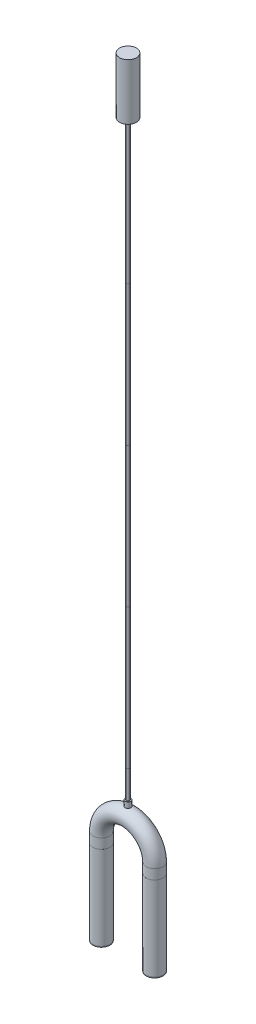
ISO-10303-21;
HEADER;
FILE_DESCRIPTION(('STEP AP214'),'2;1');
FILE_NAME('part.step','',(''),(''),'','','');
FILE_SCHEMA(('AUTOMOTIVE_DESIGN { 1 0 10303 214 1 1 1 1 }'));
ENDSEC;
DATA;
#1=APPLICATION_CONTEXT('core data for automotive mechanical design processes');
#2=APPLICATION_PROTOCOL_DEFINITION('international standard','automotive_design',2000,#1);
#3=PRODUCT_CONTEXT('',#1,'mechanical');
#4=PRODUCT('Part','Part','',(#3));
#5=PRODUCT_RELATED_PRODUCT_CATEGORY('part','',(#4));
#6=PRODUCT_DEFINITION_FORMATION('','',#4);
#7=PRODUCT_DEFINITION_CONTEXT('part definition',#1,'design');
#8=PRODUCT_DEFINITION('design','',#6,#7);
#9=PRODUCT_DEFINITION_SHAPE('','',#8);
#10=(LENGTH_UNIT() NAMED_UNIT(*) SI_UNIT(.MILLI.,.METRE.));
#11=(NAMED_UNIT(*) PLANE_ANGLE_UNIT() SI_UNIT($,.RADIAN.));
#12=(NAMED_UNIT(*) SI_UNIT($,.STERADIAN.) SOLID_ANGLE_UNIT());
#13=UNCERTAINTY_MEASURE_WITH_UNIT(LENGTH_MEASURE(1.E-05),#10,'distance_accuracy_value','');
#14=(GEOMETRIC_REPRESENTATION_CONTEXT(3) GLOBAL_UNCERTAINTY_ASSIGNED_CONTEXT((#13)) GLOBAL_UNIT_ASSIGNED_CONTEXT((#10,
#11,#12)) REPRESENTATION_CONTEXT('',''));
#15=CARTESIAN_POINT('',(0.,0.,0.));
#16=DIRECTION('',(0.,0.,1.));
#17=DIRECTION('',(1.,0.,0.));
#18=AXIS2_PLACEMENT_3D('',#15,#16,#17);
#19=CARTESIAN_POINT('',(0.,2490.,0.));
#20=DIRECTION('',(0.,-1.,0.));
#21=DIRECTION('',(0.,0.,-1.));
#22=AXIS2_PLACEMENT_3D('',#19,#20,#21);
#23=CYLINDRICAL_SURFACE('',#22,30.);
#24=CARTESIAN_POINT('',(0.,2490.,0.));
#25=DIRECTION('',(0.,1.,0.));
#26=DIRECTION('',(0.,0.,1.));
#27=AXIS2_PLACEMENT_3D('',#24,#25,#26);
#28=CIRCLE('',#27,30.);
#29=CARTESIAN_POINT('',(0.,2490.,30.));
#30=VERTEX_POINT('',#29);
#31=EDGE_CURVE('E12',#30,#30,#28,.T.);
#32=ORIENTED_EDGE('',*,*,#31,.F.);
#33=EDGE_LOOP('',(#32));
#34=FACE_BOUND('',#33,.T.);
#35=CARTESIAN_POINT('',(0.,2290.,0.));
#36=DIRECTION('',(0.,1.,0.));
#37=DIRECTION('',(0.,0.,1.));
#38=AXIS2_PLACEMENT_3D('',#35,#36,#37);
#39=CIRCLE('',#38,30.);
#40=CARTESIAN_POINT('',(0.,2290.,30.));
#41=VERTEX_POINT('',#40);
#42=EDGE_CURVE('E55',#41,#41,#39,.T.);
#43=ORIENTED_EDGE('',*,*,#42,.T.);
#44=EDGE_LOOP('',(#43));
#45=FACE_BOUND('',#44,.T.);
#46=ADVANCED_FACE('F52',(#34,#45),#23,.T.);
#47=CARTESIAN_POINT('',(0.,2490.,0.));
#48=DIRECTION('',(0.,1.,0.));
#49=DIRECTION('',(0.,0.,1.));
#50=AXIS2_PLACEMENT_3D('',#47,#48,#49);
#51=PLANE('',#50);
#52=ORIENTED_EDGE('',*,*,#31,.T.);
#53=EDGE_LOOP('',(#52));
#54=FACE_BOUND('',#53,.T.);
#55=ADVANCED_FACE('F67',(#54),#51,.T.);
#56=CARTESIAN_POINT('',(0.,2290.,0.));
#57=DIRECTION('',(0.,1.,0.));
#58=DIRECTION('',(0.,0.,1.));
#59=AXIS2_PLACEMENT_3D('',#56,#57,#58);
#60=PLANE('',#59);
#61=ORIENTED_EDGE('',*,*,#42,.F.);
#62=EDGE_LOOP('',(#61));
#63=FACE_BOUND('',#62,.T.);
#64=ADVANCED_FACE('F65',(#63),#60,.F.);
#65=CLOSED_SHELL('',(#46,#55,#64));
#66=MANIFOLD_SOLID_BREP('B2',#65);
#67=CARTESIAN_POINT('',(0.,2290.,0.));
#68=DIRECTION('',(0.,-1.,0.));
#69=DIRECTION('',(0.,0.,-1.));
#70=AXIS2_PLACEMENT_3D('',#67,#68,#69);
#71=CYLINDRICAL_SURFACE('',#70,7.5);
#72=CARTESIAN_POINT('',(0.,2290.,0.));
#73=DIRECTION('',(0.,1.,0.));
#74=DIRECTION('',(0.,0.,1.));
#75=AXIS2_PLACEMENT_3D('',#72,#73,#74);
#76=CIRCLE('',#75,7.5);
#77=CARTESIAN_POINT('',(0.,2290.,7.5));
#78=VERTEX_POINT('',#77);
#79=EDGE_CURVE('E51',#78,#78,#76,.T.);
#80=ORIENTED_EDGE('',*,*,#79,.F.);
#81=EDGE_LOOP('',(#80));
#82=FACE_BOUND('',#81,.T.);
#83=CARTESIAN_POINT('',(0.,2280.,0.));
#84=DIRECTION('',(0.,1.,0.));
#85=DIRECTION('',(0.,0.,1.));
#86=AXIS2_PLACEMENT_3D('',#83,#84,#85);
#87=CIRCLE('',#86,7.5);
#88=CARTESIAN_POINT('',(0.,2280.,7.5));
#89=VERTEX_POINT('',#88);
#90=EDGE_CURVE('E104',#89,#89,#87,.T.);
#91=ORIENTED_EDGE('',*,*,#90,.T.);
#92=EDGE_LOOP('',(#91));
#93=FACE_BOUND('',#92,.T.);
#94=ADVANCED_FACE('F101',(#82,#93),#71,.T.);
#95=CARTESIAN_POINT('',(0.,2290.,0.));
#96=DIRECTION('',(0.,1.,0.));
#97=DIRECTION('',(0.,0.,1.));
#98=AXIS2_PLACEMENT_3D('',#95,#96,#97);
#99=PLANE('',#98);
#100=ORIENTED_EDGE('',*,*,#79,.T.);
#101=EDGE_LOOP('',(#100));
#102=FACE_BOUND('',#101,.T.);
#103=ADVANCED_FACE('F116',(#102),#99,.T.);
#104=CARTESIAN_POINT('',(0.,2280.,0.));
#105=DIRECTION('',(0.,1.,0.));
#106=DIRECTION('',(0.,0.,1.));
#107=AXIS2_PLACEMENT_3D('',#104,#105,#106);
#108=PLANE('',#107);
#109=ORIENTED_EDGE('',*,*,#90,.F.);
#110=EDGE_LOOP('',(#109));
#111=FACE_BOUND('',#110,.T.);
#112=ADVANCED_FACE('F114',(#111),#108,.F.);
#113=CLOSED_SHELL('',(#94,#103,#112));
#114=MANIFOLD_SOLID_BREP('B7',#113);
#115=CARTESIAN_POINT('',(94.9999999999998,-303.,0.));
#116=DIRECTION('',(0.,1.,0.));
#117=DIRECTION('',(-1.,0.,0.));
#118=AXIS2_PLACEMENT_3D('',#115,#116,#117);
#119=CYLINDRICAL_SURFACE('',#118,30.);
#120=CARTESIAN_POINT('',(94.9999999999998,-303.,0.));
#121=DIRECTION('',(0.,-1.,0.));
#122=DIRECTION('',(1.,0.,0.));
#123=AXIS2_PLACEMENT_3D('',#120,#121,#122);
#124=CIRCLE('',#123,30.);
#125=CARTESIAN_POINT('',(125.,-303.,0.));
#126=VERTEX_POINT('',#125);
#127=EDGE_CURVE('E100',#126,#126,#124,.T.);
#128=ORIENTED_EDGE('',*,*,#127,.F.);
#129=EDGE_LOOP('',(#128));
#130=FACE_BOUND('',#129,.T.);
#131=CARTESIAN_POINT('',(94.9999999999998,-300.,0.));
#132=DIRECTION('',(0.,-1.,0.));
#133=DIRECTION('',(1.,0.,0.));
#134=AXIS2_PLACEMENT_3D('',#131,#132,#133);
#135=CIRCLE('',#134,30.);
#136=CARTESIAN_POINT('',(125.,-300.,0.));
#137=VERTEX_POINT('',#136);
#138=EDGE_CURVE('E153',#137,#137,#135,.T.);
#139=ORIENTED_EDGE('',*,*,#138,.T.);
#140=EDGE_LOOP('',(#139));
#141=FACE_BOUND('',#140,.T.);
#142=ADVANCED_FACE('F150',(#130,#141),#119,.T.);
#143=CARTESIAN_POINT('',(94.9999999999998,-303.,0.));
#144=DIRECTION('',(0.,-1.,0.));
#145=DIRECTION('',(1.,0.,0.));
#146=AXIS2_PLACEMENT_3D('',#143,#144,#145);
#147=PLANE('',#146);
#148=ORIENTED_EDGE('',*,*,#127,.T.);
#149=EDGE_LOOP('',(#148));
#150=FACE_BOUND('',#149,.T.);
#151=ADVANCED_FACE('F165',(#150),#147,.T.);
#152=CARTESIAN_POINT('',(94.9999999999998,-300.,0.));
#153=DIRECTION('',(0.,-1.,0.));
#154=DIRECTION('',(1.,0.,0.));
#155=AXIS2_PLACEMENT_3D('',#152,#153,#154);
#156=PLANE('',#155);
#157=ORIENTED_EDGE('',*,*,#138,.F.);
#158=EDGE_LOOP('',(#157));
#159=FACE_BOUND('',#158,.T.);
#160=ADVANCED_FACE('F163',(#159),#156,.F.);
#161=CLOSED_SHELL('',(#142,#151,#160));
#162=MANIFOLD_SOLID_BREP('B46',#161);
#163=CARTESIAN_POINT('',(-95.0000000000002,-303.,0.));
#164=DIRECTION('',(0.,1.,0.));
#165=DIRECTION('',(-1.,0.,0.));
#166=AXIS2_PLACEMENT_3D('',#163,#164,#165);
#167=CYLINDRICAL_SURFACE('',#166,30.);
#168=CARTESIAN_POINT('',(-95.0000000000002,-303.,0.));
#169=DIRECTION('',(0.,-1.,0.));
#170=DIRECTION('',(1.,0.,0.));
#171=AXIS2_PLACEMENT_3D('',#168,#169,#170);
#172=CIRCLE('',#171,30.);
#173=CARTESIAN_POINT('',(-65.0000000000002,-303.,0.));
#174=VERTEX_POINT('',#173);
#175=EDGE_CURVE('E149',#174,#174,#172,.T.);
#176=ORIENTED_EDGE('',*,*,#175,.F.);
#177=EDGE_LOOP('',(#176));
#178=FACE_BOUND('',#177,.T.);
#179=CARTESIAN_POINT('',(-95.0000000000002,-300.,0.));
#180=DIRECTION('',(0.,-1.,0.));
#181=DIRECTION('',(1.,0.,0.));
#182=AXIS2_PLACEMENT_3D('',#179,#180,#181);
#183=CIRCLE('',#182,30.);
#184=CARTESIAN_POINT('',(-65.0000000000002,-300.,0.));
#185=VERTEX_POINT('',#184);
#186=EDGE_CURVE('E202',#185,#185,#183,.T.);
#187=ORIENTED_EDGE('',*,*,#186,.T.);
#188=EDGE_LOOP('',(#187));
#189=FACE_BOUND('',#188,.T.);
#190=ADVANCED_FACE('F199',(#178,#189),#167,.T.);
#191=CARTESIAN_POINT('',(-95.0000000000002,-303.,0.));
#192=DIRECTION('',(0.,-1.,0.));
#193=DIRECTION('',(1.,0.,0.));
#194=AXIS2_PLACEMENT_3D('',#191,#192,#193);
#195=PLANE('',#194);
#196=ORIENTED_EDGE('',*,*,#175,.T.);
#197=EDGE_LOOP('',(#196));
#198=FACE_BOUND('',#197,.T.);
#199=ADVANCED_FACE('F214',(#198),#195,.T.);
#200=CARTESIAN_POINT('',(-95.0000000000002,-300.,0.));
#201=DIRECTION('',(0.,-1.,0.));
#202=DIRECTION('',(1.,0.,0.));
#203=AXIS2_PLACEMENT_3D('',#200,#201,#202);
#204=PLANE('',#203);
#205=ORIENTED_EDGE('',*,*,#186,.F.);
#206=EDGE_LOOP('',(#205));
#207=FACE_BOUND('',#206,.T.);
#208=ADVANCED_FACE('F212',(#207),#204,.F.);
#209=CLOSED_SHELL('',(#190,#199,#208));
#210=MANIFOLD_SOLID_BREP('B95',#209);
#211=CARTESIAN_POINT('',(-95.0000000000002,-300.,0.));
#212=DIRECTION('',(0.,-1.,0.));
#213=DIRECTION('',(1.,0.,0.));
#214=AXIS2_PLACEMENT_3D('',#211,#212,#213);
#215=PLANE('',#214);
#216=CARTESIAN_POINT('',(-95.0000000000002,-300.,0.));
#217=DIRECTION('',(0.,-1.,0.));
#218=DIRECTION('',(1.,0.,0.));
#219=AXIS2_PLACEMENT_3D('',#216,#217,#218);
#220=CIRCLE('',#219,30.);
#221=CARTESIAN_POINT('',(-65.0000000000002,-300.,0.));
#222=VERTEX_POINT('',#221);
#223=EDGE_CURVE('E198',#222,#222,#220,.T.);
#224=ORIENTED_EDGE('',*,*,#223,.T.);
#225=EDGE_LOOP('',(#224));
#226=FACE_BOUND('',#225,.T.);
#227=CARTESIAN_POINT('',(-95.0000000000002,-300.,0.));
#228=DIRECTION('',(0.,-1.,0.));
#229=DIRECTION('',(1.,0.,0.));
#230=AXIS2_PLACEMENT_3D('',#227,#228,#229);
#231=CIRCLE('',#230,27.);
#232=CARTESIAN_POINT('',(-68.0000000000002,-300.,0.));
#233=VERTEX_POINT('',#232);
#234=EDGE_CURVE('E259',#233,#233,#231,.T.);
#235=ORIENTED_EDGE('',*,*,#234,.F.);
#236=EDGE_LOOP('',(#235));
#237=FACE_BOUND('',#236,.T.);
#238=ADVANCED_FACE('F248',(#226,#237),#215,.T.);
#239=CARTESIAN_POINT('',(-95.,0.,0.));
#240=DIRECTION('',(0.,-1.,0.));
#241=DIRECTION('',(1.,0.,0.));
#242=AXIS2_PLACEMENT_3D('',#239,#240,#241);
#243=PLANE('',#242);
#244=CARTESIAN_POINT('',(-95.,0.,0.));
#245=DIRECTION('',(0.,-1.,0.));
#246=DIRECTION('',(1.,0.,0.));
#247=AXIS2_PLACEMENT_3D('',#244,#245,#246);
#248=CIRCLE('',#247,30.);
#249=CARTESIAN_POINT('',(-65.,0.,0.));
#250=VERTEX_POINT('',#249);
#251=EDGE_CURVE('E252',#250,#250,#248,.T.);
#252=ORIENTED_EDGE('',*,*,#251,.F.);
#253=EDGE_LOOP('',(#252));
#254=FACE_BOUND('',#253,.T.);
#255=CARTESIAN_POINT('',(-95.,0.,0.));
#256=DIRECTION('',(0.,-1.,0.));
#257=DIRECTION('',(1.,0.,0.));
#258=AXIS2_PLACEMENT_3D('',#255,#256,#257);
#259=CIRCLE('',#258,27.);
#260=CARTESIAN_POINT('',(-68.,0.,0.));
#261=VERTEX_POINT('',#260);
#262=EDGE_CURVE('E261',#261,#261,#259,.T.);
#263=ORIENTED_EDGE('',*,*,#262,.T.);
#264=EDGE_LOOP('',(#263));
#265=FACE_BOUND('',#264,.T.);
#266=ADVANCED_FACE('F271',(#254,#265),#243,.F.);
#267=CARTESIAN_POINT('',(-95.0000000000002,-300.,0.));
#268=DIRECTION('',(0.,1.,0.));
#269=DIRECTION('',(-1.,0.,0.));
#270=AXIS2_PLACEMENT_3D('',#267,#268,#269);
#271=CYLINDRICAL_SURFACE('',#270,30.);
#272=ORIENTED_EDGE('',*,*,#223,.F.);
#273=EDGE_LOOP('',(#272));
#274=FACE_BOUND('',#273,.T.);
#275=ORIENTED_EDGE('',*,*,#251,.T.);
#276=EDGE_LOOP('',(#275));
#277=FACE_BOUND('',#276,.T.);
#278=ADVANCED_FACE('F250',(#274,#277),#271,.T.);
#279=CARTESIAN_POINT('',(-95.0000000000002,-300.,0.));
#280=DIRECTION('',(0.,1.,0.));
#281=DIRECTION('',(-1.,0.,0.));
#282=AXIS2_PLACEMENT_3D('',#279,#280,#281);
#283=CYLINDRICAL_SURFACE('',#282,27.);
#284=ORIENTED_EDGE('',*,*,#234,.T.);
#285=EDGE_LOOP('',(#284));
#286=FACE_BOUND('',#285,.T.);
#287=ORIENTED_EDGE('',*,*,#262,.F.);
#288=EDGE_LOOP('',(#287));
#289=FACE_BOUND('',#288,.T.);
#290=ADVANCED_FACE('F267',(#286,#289),#283,.F.);
#291=CLOSED_SHELL('',(#238,#266,#278,#290));
#292=MANIFOLD_SOLID_BREP('B144',#291);
#293=CARTESIAN_POINT('',(94.9999999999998,-300.,0.));
#294=DIRECTION('',(0.,-1.,0.));
#295=DIRECTION('',(1.,0.,0.));
#296=AXIS2_PLACEMENT_3D('',#293,#294,#295);
#297=PLANE('',#296);
#298=CARTESIAN_POINT('',(94.9999999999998,-300.,0.));
#299=DIRECTION('',(0.,-1.,0.));
#300=DIRECTION('',(1.,0.,0.));
#301=AXIS2_PLACEMENT_3D('',#298,#299,#300);
#302=CIRCLE('',#301,30.);
#303=CARTESIAN_POINT('',(125.,-300.,0.));
#304=VERTEX_POINT('',#303);
#305=EDGE_CURVE('E247',#304,#304,#302,.T.);
#306=ORIENTED_EDGE('',*,*,#305,.T.);
#307=EDGE_LOOP('',(#306));
#308=FACE_BOUND('',#307,.T.);
#309=CARTESIAN_POINT('',(94.9999999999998,-300.,0.));
#310=DIRECTION('',(0.,-1.,0.));
#311=DIRECTION('',(1.,0.,0.));
#312=AXIS2_PLACEMENT_3D('',#309,#310,#311);
#313=CIRCLE('',#312,27.);
#314=CARTESIAN_POINT('',(122.,-300.,0.));
#315=VERTEX_POINT('',#314);
#316=EDGE_CURVE('E329',#315,#315,#313,.T.);
#317=ORIENTED_EDGE('',*,*,#316,.F.);
#318=EDGE_LOOP('',(#317));
#319=FACE_BOUND('',#318,.T.);
#320=ADVANCED_FACE('F318',(#308,#319),#297,.T.);
#321=CARTESIAN_POINT('',(95.,0.,0.));
#322=DIRECTION('',(0.,-1.,0.));
#323=DIRECTION('',(1.,0.,0.));
#324=AXIS2_PLACEMENT_3D('',#321,#322,#323);
#325=PLANE('',#324);
#326=CARTESIAN_POINT('',(95.,0.,0.));
#327=DIRECTION('',(0.,-1.,0.));
#328=DIRECTION('',(1.,0.,0.));
#329=AXIS2_PLACEMENT_3D('',#326,#327,#328);
#330=CIRCLE('',#329,30.);
#331=CARTESIAN_POINT('',(125.,0.,0.));
#332=VERTEX_POINT('',#331);
#333=EDGE_CURVE('E322',#332,#332,#330,.T.);
#334=ORIENTED_EDGE('',*,*,#333,.F.);
#335=EDGE_LOOP('',(#334));
#336=FACE_BOUND('',#335,.T.);
#337=CARTESIAN_POINT('',(95.,0.,0.));
#338=DIRECTION('',(0.,-1.,0.));
#339=DIRECTION('',(1.,0.,0.));
#340=AXIS2_PLACEMENT_3D('',#337,#338,#339);
#341=CIRCLE('',#340,27.);
#342=CARTESIAN_POINT('',(122.,0.,0.));
#343=VERTEX_POINT('',#342);
#344=EDGE_CURVE('E331',#343,#343,#341,.T.);
#345=ORIENTED_EDGE('',*,*,#344,.T.);
#346=EDGE_LOOP('',(#345));
#347=FACE_BOUND('',#346,.T.);
#348=ADVANCED_FACE('F341',(#336,#347),#325,.F.);
#349=CARTESIAN_POINT('',(94.9999999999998,-300.,0.));
#350=DIRECTION('',(0.,1.,0.));
#351=DIRECTION('',(-1.,0.,0.));
#352=AXIS2_PLACEMENT_3D('',#349,#350,#351);
#353=CYLINDRICAL_SURFACE('',#352,30.);
#354=ORIENTED_EDGE('',*,*,#305,.F.);
#355=EDGE_LOOP('',(#354));
#356=FACE_BOUND('',#355,.T.);
#357=ORIENTED_EDGE('',*,*,#333,.T.);
#358=EDGE_LOOP('',(#357));
#359=FACE_BOUND('',#358,.T.);
#360=ADVANCED_FACE('F320',(#356,#359),#353,.T.);
#361=CARTESIAN_POINT('',(94.9999999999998,-300.,0.));
#362=DIRECTION('',(0.,1.,0.));
#363=DIRECTION('',(-1.,0.,0.));
#364=AXIS2_PLACEMENT_3D('',#361,#362,#363);
#365=CYLINDRICAL_SURFACE('',#364,27.);
#366=ORIENTED_EDGE('',*,*,#316,.T.);
#367=EDGE_LOOP('',(#366));
#368=FACE_BOUND('',#367,.T.);
#369=ORIENTED_EDGE('',*,*,#344,.F.);
#370=EDGE_LOOP('',(#369));
#371=FACE_BOUND('',#370,.T.);
#372=ADVANCED_FACE('F337',(#368,#371),#365,.F.);
#373=CLOSED_SHELL('',(#320,#348,#360,#372));
#374=MANIFOLD_SOLID_BREP('B193',#373);
#375=CARTESIAN_POINT('',(0.,2280.,0.));
#376=DIRECTION('',(0.,-1.,0.));
#377=DIRECTION('',(0.,0.,-1.));
#378=AXIS2_PLACEMENT_3D('',#375,#376,#377);
#379=CYLINDRICAL_SURFACE('',#378,6.);
#380=CARTESIAN_POINT('',(0.,2280.,0.));
#381=DIRECTION('',(0.,1.,0.));
#382=DIRECTION('',(0.,0.,1.));
#383=AXIS2_PLACEMENT_3D('',#380,#381,#382);
#384=CIRCLE('',#383,6.);
#385=CARTESIAN_POINT('',(0.,2280.,6.));
#386=VERTEX_POINT('',#385);
#387=EDGE_CURVE('E317',#386,#386,#384,.T.);
#388=ORIENTED_EDGE('',*,*,#387,.F.);
#389=EDGE_LOOP('',(#388));
#390=FACE_BOUND('',#389,.T.);
#391=CARTESIAN_POINT('',(0.,1780.,0.));
#392=DIRECTION('',(0.,1.,0.));
#393=DIRECTION('',(0.,0.,1.));
#394=AXIS2_PLACEMENT_3D('',#391,#392,#393);
#395=CIRCLE('',#394,6.);
#396=CARTESIAN_POINT('',(0.,1780.,6.));
#397=VERTEX_POINT('',#396);
#398=EDGE_CURVE('E391',#397,#397,#395,.T.);
#399=ORIENTED_EDGE('',*,*,#398,.T.);
#400=EDGE_LOOP('',(#399));
#401=FACE_BOUND('',#400,.T.);
#402=ADVANCED_FACE('F388',(#390,#401),#379,.T.);
#403=CARTESIAN_POINT('',(0.,2280.,0.));
#404=DIRECTION('',(0.,1.,0.));
#405=DIRECTION('',(0.,0.,1.));
#406=AXIS2_PLACEMENT_3D('',#403,#404,#405);
#407=PLANE('',#406);
#408=ORIENTED_EDGE('',*,*,#387,.T.);
#409=EDGE_LOOP('',(#408));
#410=FACE_BOUND('',#409,.T.);
#411=ADVANCED_FACE('F403',(#410),#407,.T.);
#412=CARTESIAN_POINT('',(0.,1780.,0.));
#413=DIRECTION('',(0.,1.,0.));
#414=DIRECTION('',(0.,0.,1.));
#415=AXIS2_PLACEMENT_3D('',#412,#413,#414);
#416=PLANE('',#415);
#417=ORIENTED_EDGE('',*,*,#398,.F.);
#418=EDGE_LOOP('',(#417));
#419=FACE_BOUND('',#418,.T.);
#420=ADVANCED_FACE('F401',(#419),#416,.F.);
#421=CLOSED_SHELL('',(#402,#411,#420));
#422=MANIFOLD_SOLID_BREP('B242',#421);
#423=CARTESIAN_POINT('',(0.,1780.,0.));
#424=DIRECTION('',(0.,-1.,0.));
#425=DIRECTION('',(0.,0.,-1.));
#426=AXIS2_PLACEMENT_3D('',#423,#424,#425);
#427=CYLINDRICAL_SURFACE('',#426,6.);
#428=CARTESIAN_POINT('',(0.,1780.,0.));
#429=DIRECTION('',(0.,1.,0.));
#430=DIRECTION('',(0.,0.,1.));
#431=AXIS2_PLACEMENT_3D('',#428,#429,#430);
#432=CIRCLE('',#431,6.);
#433=CARTESIAN_POINT('',(0.,1780.,6.));
#434=VERTEX_POINT('',#433);
#435=EDGE_CURVE('E387',#434,#434,#432,.T.);
#436=ORIENTED_EDGE('',*,*,#435,.F.);
#437=EDGE_LOOP('',(#436));
#438=FACE_BOUND('',#437,.T.);
#439=CARTESIAN_POINT('',(0.,1280.,0.));
#440=DIRECTION('',(0.,1.,0.));
#441=DIRECTION('',(0.,0.,1.));
#442=AXIS2_PLACEMENT_3D('',#439,#440,#441);
#443=CIRCLE('',#442,6.);
#444=CARTESIAN_POINT('',(0.,1280.,6.));
#445=VERTEX_POINT('',#444);
#446=EDGE_CURVE('E440',#445,#445,#443,.T.);
#447=ORIENTED_EDGE('',*,*,#446,.T.);
#448=EDGE_LOOP('',(#447));
#449=FACE_BOUND('',#448,.T.);
#450=ADVANCED_FACE('F437',(#438,#449),#427,.T.);
#451=CARTESIAN_POINT('',(0.,1780.,0.));
#452=DIRECTION('',(0.,1.,0.));
#453=DIRECTION('',(0.,0.,1.));
#454=AXIS2_PLACEMENT_3D('',#451,#452,#453);
#455=PLANE('',#454);
#456=ORIENTED_EDGE('',*,*,#435,.T.);
#457=EDGE_LOOP('',(#456));
#458=FACE_BOUND('',#457,.T.);
#459=ADVANCED_FACE('F452',(#458),#455,.T.);
#460=CARTESIAN_POINT('',(0.,1280.,0.));
#461=DIRECTION('',(0.,1.,0.));
#462=DIRECTION('',(0.,0.,1.));
#463=AXIS2_PLACEMENT_3D('',#460,#461,#462);
#464=PLANE('',#463);
#465=ORIENTED_EDGE('',*,*,#446,.F.);
#466=EDGE_LOOP('',(#465));
#467=FACE_BOUND('',#466,.T.);
#468=ADVANCED_FACE('F450',(#467),#464,.F.);
#469=CLOSED_SHELL('',(#450,#459,#468));
#470=MANIFOLD_SOLID_BREP('B312',#469);
#471=CARTESIAN_POINT('',(0.,1280.,0.));
#472=DIRECTION('',(0.,-1.,0.));
#473=DIRECTION('',(0.,0.,-1.));
#474=AXIS2_PLACEMENT_3D('',#471,#472,#473);
#475=CYLINDRICAL_SURFACE('',#474,6.);
#476=CARTESIAN_POINT('',(0.,1280.,0.));
#477=DIRECTION('',(0.,1.,0.));
#478=DIRECTION('',(0.,0.,1.));
#479=AXIS2_PLACEMENT_3D('',#476,#477,#478);
#480=CIRCLE('',#479,6.);
#481=CARTESIAN_POINT('',(0.,1280.,6.));
#482=VERTEX_POINT('',#481);
#483=EDGE_CURVE('E436',#482,#482,#480,.T.);
#484=ORIENTED_EDGE('',*,*,#483,.F.);
#485=EDGE_LOOP('',(#484));
#486=FACE_BOUND('',#485,.T.);
#487=CARTESIAN_POINT('',(0.,780.,0.));
#488=DIRECTION('',(0.,1.,0.));
#489=DIRECTION('',(0.,0.,1.));
#490=AXIS2_PLACEMENT_3D('',#487,#488,#489);
#491=CIRCLE('',#490,6.);
#492=CARTESIAN_POINT('',(0.,780.,6.));
#493=VERTEX_POINT('',#492);
#494=EDGE_CURVE('E489',#493,#493,#491,.T.);
#495=ORIENTED_EDGE('',*,*,#494,.T.);
#496=EDGE_LOOP('',(#495));
#497=FACE_BOUND('',#496,.T.);
#498=ADVANCED_FACE('F486',(#486,#497),#475,.T.);
#499=CARTESIAN_POINT('',(0.,1280.,0.));
#500=DIRECTION('',(0.,1.,0.));
#501=DIRECTION('',(0.,0.,1.));
#502=AXIS2_PLACEMENT_3D('',#499,#500,#501);
#503=PLANE('',#502);
#504=ORIENTED_EDGE('',*,*,#483,.T.);
#505=EDGE_LOOP('',(#504));
#506=FACE_BOUND('',#505,.T.);
#507=ADVANCED_FACE('F501',(#506),#503,.T.);
#508=CARTESIAN_POINT('',(0.,780.,0.));
#509=DIRECTION('',(0.,1.,0.));
#510=DIRECTION('',(0.,0.,1.));
#511=AXIS2_PLACEMENT_3D('',#508,#509,#510);
#512=PLANE('',#511);
#513=ORIENTED_EDGE('',*,*,#494,.F.);
#514=EDGE_LOOP('',(#513));
#515=FACE_BOUND('',#514,.T.);
#516=ADVANCED_FACE('F499',(#515),#512,.F.);
#517=CLOSED_SHELL('',(#498,#507,#516));
#518=MANIFOLD_SOLID_BREP('B382',#517);
#519=CARTESIAN_POINT('',(0.,780.,0.));
#520=DIRECTION('',(0.,-1.,0.));
#521=DIRECTION('',(0.,0.,-1.));
#522=AXIS2_PLACEMENT_3D('',#519,#520,#521);
#523=CYLINDRICAL_SURFACE('',#522,6.);
#524=CARTESIAN_POINT('',(0.,780.,0.));
#525=DIRECTION('',(0.,1.,0.));
#526=DIRECTION('',(0.,0.,1.));
#527=AXIS2_PLACEMENT_3D('',#524,#525,#526);
#528=CIRCLE('',#527,6.);
#529=CARTESIAN_POINT('',(0.,780.,6.));
#530=VERTEX_POINT('',#529);
#531=EDGE_CURVE('E485',#530,#530,#528,.T.);
#532=ORIENTED_EDGE('',*,*,#531,.F.);
#533=EDGE_LOOP('',(#532));
#534=FACE_BOUND('',#533,.T.);
#535=CARTESIAN_POINT('',(0.,280.,0.));
#536=DIRECTION('',(0.,1.,0.));
#537=DIRECTION('',(0.,0.,1.));
#538=AXIS2_PLACEMENT_3D('',#535,#536,#537);
#539=CIRCLE('',#538,6.);
#540=CARTESIAN_POINT('',(0.,280.,6.));
#541=VERTEX_POINT('',#540);
#542=EDGE_CURVE('E538',#541,#541,#539,.T.);
#543=ORIENTED_EDGE('',*,*,#542,.T.);
#544=EDGE_LOOP('',(#543));
#545=FACE_BOUND('',#544,.T.);
#546=ADVANCED_FACE('F535',(#534,#545),#523,.T.);
#547=CARTESIAN_POINT('',(0.,780.,0.));
#548=DIRECTION('',(0.,1.,0.));
#549=DIRECTION('',(0.,0.,1.));
#550=AXIS2_PLACEMENT_3D('',#547,#548,#549);
#551=PLANE('',#550);
#552=ORIENTED_EDGE('',*,*,#531,.T.);
#553=EDGE_LOOP('',(#552));
#554=FACE_BOUND('',#553,.T.);
#555=ADVANCED_FACE('F550',(#554),#551,.T.);
#556=CARTESIAN_POINT('',(0.,280.,0.));
#557=DIRECTION('',(0.,1.,0.));
#558=DIRECTION('',(0.,0.,1.));
#559=AXIS2_PLACEMENT_3D('',#556,#557,#558);
#560=PLANE('',#559);
#561=ORIENTED_EDGE('',*,*,#542,.F.);
#562=EDGE_LOOP('',(#561));
#563=FACE_BOUND('',#562,.T.);
#564=ADVANCED_FACE('F548',(#563),#560,.F.);
#565=CLOSED_SHELL('',(#546,#555,#564));
#566=MANIFOLD_SOLID_BREP('B431',#565);
#567=CARTESIAN_POINT('',(0.,280.,0.));
#568=DIRECTION('',(0.,-1.,0.));
#569=DIRECTION('',(0.,0.,-1.));
#570=AXIS2_PLACEMENT_3D('',#567,#568,#569);
#571=CYLINDRICAL_SURFACE('',#570,6.);
#572=CARTESIAN_POINT('',(0.,280.,0.));
#573=DIRECTION('',(0.,1.,0.));
#574=DIRECTION('',(0.,0.,1.));
#575=AXIS2_PLACEMENT_3D('',#572,#573,#574);
#576=CIRCLE('',#575,6.);
#577=CARTESIAN_POINT('',(0.,280.,6.));
#578=VERTEX_POINT('',#577);
#579=EDGE_CURVE('E534',#578,#578,#576,.T.);
#580=ORIENTED_EDGE('',*,*,#579,.F.);
#581=EDGE_LOOP('',(#580));
#582=FACE_BOUND('',#581,.T.);
#583=CARTESIAN_POINT('',(0.,180.,0.));
#584=DIRECTION('',(0.,1.,0.));
#585=DIRECTION('',(0.,0.,1.));
#586=AXIS2_PLACEMENT_3D('',#583,#584,#585);
#587=CIRCLE('',#586,6.);
#588=CARTESIAN_POINT('',(0.,180.,6.));
#589=VERTEX_POINT('',#588);
#590=EDGE_CURVE('E587',#589,#589,#587,.T.);
#591=ORIENTED_EDGE('',*,*,#590,.T.);
#592=EDGE_LOOP('',(#591));
#593=FACE_BOUND('',#592,.T.);
#594=ADVANCED_FACE('F584',(#582,#593),#571,.T.);
#595=CARTESIAN_POINT('',(0.,280.,0.));
#596=DIRECTION('',(0.,1.,0.));
#597=DIRECTION('',(0.,0.,1.));
#598=AXIS2_PLACEMENT_3D('',#595,#596,#597);
#599=PLANE('',#598);
#600=ORIENTED_EDGE('',*,*,#579,.T.);
#601=EDGE_LOOP('',(#600));
#602=FACE_BOUND('',#601,.T.);
#603=ADVANCED_FACE('F599',(#602),#599,.T.);
#604=CARTESIAN_POINT('',(0.,180.,0.));
#605=DIRECTION('',(0.,1.,0.));
#606=DIRECTION('',(0.,0.,1.));
#607=AXIS2_PLACEMENT_3D('',#604,#605,#606);
#608=PLANE('',#607);
#609=ORIENTED_EDGE('',*,*,#590,.F.);
#610=EDGE_LOOP('',(#609));
#611=FACE_BOUND('',#610,.T.);
#612=ADVANCED_FACE('F597',(#611),#608,.F.);
#613=CLOSED_SHELL('',(#594,#603,#612));
#614=MANIFOLD_SOLID_BREP('B480',#613);
#615=CARTESIAN_POINT('',(0.,180.,0.));
#616=DIRECTION('',(0.,-1.,0.));
#617=DIRECTION('',(0.,0.,-1.));
#618=AXIS2_PLACEMENT_3D('',#615,#616,#617);
#619=CYLINDRICAL_SURFACE('',#618,10.);
#620=CARTESIAN_POINT('',(0.,180.,0.));
#621=DIRECTION('',(0.,1.,0.));
#622=DIRECTION('',(0.,0.,1.));
#623=AXIS2_PLACEMENT_3D('',#620,#621,#622);
#624=CIRCLE('',#623,10.);
#625=CARTESIAN_POINT('',(0.,180.,10.));
#626=VERTEX_POINT('',#625);
#627=EDGE_CURVE('E583',#626,#626,#624,.T.);
#628=ORIENTED_EDGE('',*,*,#627,.F.);
#629=EDGE_LOOP('',(#628));
#630=FACE_BOUND('',#629,.T.);
#631=CARTESIAN_POINT('',(0.,160.,0.));
#632=DIRECTION('',(0.,1.,0.));
#633=DIRECTION('',(0.,0.,1.));
#634=AXIS2_PLACEMENT_3D('',#631,#632,#633);
#635=CIRCLE('',#634,10.);
#636=CARTESIAN_POINT('',(0.,160.,10.));
#637=VERTEX_POINT('',#636);
#638=EDGE_CURVE('E637',#637,#637,#635,.T.);
#639=ORIENTED_EDGE('',*,*,#638,.T.);
#640=EDGE_LOOP('',(#639));
#641=FACE_BOUND('',#640,.T.);
#642=ADVANCED_FACE('F634',(#630,#641),#619,.T.);
#643=CARTESIAN_POINT('',(0.,180.,0.));
#644=DIRECTION('',(0.,1.,0.));
#645=DIRECTION('',(0.,0.,1.));
#646=AXIS2_PLACEMENT_3D('',#643,#644,#645);
#647=PLANE('',#646);
#648=ORIENTED_EDGE('',*,*,#627,.T.);
#649=EDGE_LOOP('',(#648));
#650=FACE_BOUND('',#649,.T.);
#651=ADVANCED_FACE('F649',(#650),#647,.T.);
#652=CARTESIAN_POINT('',(0.,160.,0.));
#653=DIRECTION('',(0.,1.,0.));
#654=DIRECTION('',(0.,0.,1.));
#655=AXIS2_PLACEMENT_3D('',#652,#653,#654);
#656=PLANE('',#655);
#657=ORIENTED_EDGE('',*,*,#638,.F.);
#658=EDGE_LOOP('',(#657));
#659=FACE_BOUND('',#658,.T.);
#660=ADVANCED_FACE('F647',(#659),#656,.F.);
#661=CLOSED_SHELL('',(#642,#651,#660));
#662=MANIFOLD_SOLID_BREP('B529',#661);
#663=CARTESIAN_POINT('',(-95.,0.,0.));
#664=DIRECTION('',(0.,1.,0.));
#665=DIRECTION('',(0.,0.,1.));
#666=AXIS2_PLACEMENT_3D('',#663,#664,#665);
#667=PLANE('',#666);
#668=CARTESIAN_POINT('',(-95.,0.,0.));
#669=DIRECTION('',(0.,1.,0.));
#670=DIRECTION('',(0.,0.,1.));
#671=AXIS2_PLACEMENT_3D('',#668,#669,#670);
#672=CIRCLE('',#671,27.);
#673=CARTESIAN_POINT('',(-95.,0.,27.));
#674=VERTEX_POINT('',#673);
#675=EDGE_CURVE('E710',#674,#674,#672,.T.);
#676=ORIENTED_EDGE('',*,*,#675,.T.);
#677=EDGE_LOOP('',(#676));
#678=FACE_BOUND('',#677,.T.);
#679=CARTESIAN_POINT('',(-95.,0.,0.));
#680=DIRECTION('',(0.,1.,0.));
#681=DIRECTION('',(0.,0.,1.));
#682=AXIS2_PLACEMENT_3D('',#679,#680,#681);
#683=CIRCLE('',#682,30.);
#684=CARTESIAN_POINT('',(-95.,0.,30.));
#685=VERTEX_POINT('',#684);
#686=EDGE_CURVE('E687',#685,#685,#683,.T.);
#687=ORIENTED_EDGE('',*,*,#686,.F.);
#688=EDGE_LOOP('',(#687));
#689=FACE_BOUND('',#688,.T.);
#690=ADVANCED_FACE('F675',(#678,#689),#667,.F.);
#691=CARTESIAN_POINT('',(95.,0.,0.));
#692=DIRECTION('',(0.,-1.,0.));
#693=DIRECTION('',(0.,0.,1.));
#694=AXIS2_PLACEMENT_3D('',#691,#692,#693);
#695=PLANE('',#694);
#696=CARTESIAN_POINT('',(95.,0.,0.));
#697=DIRECTION('',(0.,-1.,0.));
#698=DIRECTION('',(0.,0.,-1.));
#699=AXIS2_PLACEMENT_3D('',#696,#697,#698);
#700=CIRCLE('',#699,27.);
#701=CARTESIAN_POINT('',(95.,0.,-27.));
#702=VERTEX_POINT('',#701);
#703=EDGE_CURVE('E706',#702,#702,#700,.T.);
#704=ORIENTED_EDGE('',*,*,#703,.F.);
#705=EDGE_LOOP('',(#704));
#706=FACE_BOUND('',#705,.T.);
#707=CARTESIAN_POINT('',(95.,0.,0.));
#708=DIRECTION('',(0.,-1.,0.));
#709=DIRECTION('',(0.,0.,1.));
#710=AXIS2_PLACEMENT_3D('',#707,#708,#709);
#711=CIRCLE('',#710,30.);
#712=CARTESIAN_POINT('',(95.,0.,30.));
#713=VERTEX_POINT('',#712);
#714=EDGE_CURVE('E632',#713,#713,#711,.T.);
#715=ORIENTED_EDGE('',*,*,#714,.T.);
#716=EDGE_LOOP('',(#715));
#717=FACE_BOUND('',#716,.T.);
#718=ADVANCED_FACE('F690',(#706,#717),#695,.T.);
#719=CARTESIAN_POINT('',(-95.,0.,0.));
#720=DIRECTION('',(0.,1.,0.));
#721=DIRECTION('',(0.,0.,1.));
#722=AXIS2_PLACEMENT_3D('',#719,#720,#721);
#723=CYLINDRICAL_SURFACE('',#722,30.);
#724=CARTESIAN_POINT('',(-95.,35.,0.));
#725=DIRECTION('',(0.,1.,0.));
#726=DIRECTION('',(0.,0.,1.));
#727=AXIS2_PLACEMENT_3D('',#724,#725,#726);
#728=CIRCLE('',#727,30.);
#729=CARTESIAN_POINT('',(-125.,35.,0.));
#730=VERTEX_POINT('',#729);
#731=EDGE_CURVE('E701',#730,#730,#728,.T.);
#732=ORIENTED_EDGE('',*,*,#731,.F.);
#733=EDGE_LOOP('',(#732));
#734=FACE_BOUND('',#733,.T.);
#735=ORIENTED_EDGE('',*,*,#686,.T.);
#736=EDGE_LOOP('',(#735));
#737=FACE_BOUND('',#736,.T.);
#738=ADVANCED_FACE('F734',(#734,#737),#723,.T.);
#739=CARTESIAN_POINT('',(0.,35.,0.));
#740=DIRECTION('',(0.,0.,-1.));
#741=DIRECTION('',(-1.,0.,0.));
#742=AXIS2_PLACEMENT_3D('',#739,#740,#741);
#743=TOROIDAL_SURFACE('',#742,95.,30.);
#744=CARTESIAN_POINT('',(95.,35.,0.));
#745=DIRECTION('',(0.,-1.,0.));
#746=DIRECTION('',(0.,0.,1.));
#747=AXIS2_PLACEMENT_3D('',#744,#745,#746);
#748=CIRCLE('',#747,30.);
#749=CARTESIAN_POINT('',(125.,35.,0.));
#750=VERTEX_POINT('',#749);
#751=EDGE_CURVE('E682',#750,#750,#748,.T.);
#752=CARTESIAN_POINT('',(0.,35.,0.));
#753=DIRECTION('',(0.,0.,-1.));
#754=DIRECTION('',(-1.,0.,0.));
#755=AXIS2_PLACEMENT_3D('',#752,#753,#754);
#756=CIRCLE('',#755,125.);
#757=EDGE_CURVE('',#730,#750,#756,.T.);
#758=ORIENTED_EDGE('',*,*,#731,.T.);
#759=ORIENTED_EDGE('',*,*,#751,.F.);
#760=ORIENTED_EDGE('',*,*,#757,.T.);
#761=ORIENTED_EDGE('',*,*,#757,.F.);
#762=EDGE_LOOP('',(#758,#760,#759,#761));
#763=FACE_BOUND('',#762,.T.);
#764=ADVANCED_FACE('F696',(#763),#743,.T.);
#765=CARTESIAN_POINT('',(95.,35.,0.));
#766=DIRECTION('',(0.,-1.,0.));
#767=DIRECTION('',(0.,0.,-1.));
#768=AXIS2_PLACEMENT_3D('',#765,#766,#767);
#769=CYLINDRICAL_SURFACE('',#768,30.);
#770=ORIENTED_EDGE('',*,*,#714,.F.);
#771=EDGE_LOOP('',(#770));
#772=FACE_BOUND('',#771,.T.);
#773=ORIENTED_EDGE('',*,*,#751,.T.);
#774=EDGE_LOOP('',(#773));
#775=FACE_BOUND('',#774,.T.);
#776=ADVANCED_FACE('F692',(#772,#775),#769,.T.);
#777=CARTESIAN_POINT('',(-95.,0.,0.));
#778=DIRECTION('',(0.,1.,0.));
#779=DIRECTION('',(0.,0.,1.));
#780=AXIS2_PLACEMENT_3D('',#777,#778,#779);
#781=CYLINDRICAL_SURFACE('',#780,27.);
#782=CARTESIAN_POINT('',(-95.,35.,0.));
#783=DIRECTION('',(0.,-1.,0.));
#784=DIRECTION('',(1.,0.,0.));
#785=AXIS2_PLACEMENT_3D('',#782,#783,#784);
#786=CIRCLE('',#785,27.);
#787=CARTESIAN_POINT('',(-122.,35.,0.));
#788=VERTEX_POINT('',#787);
#789=EDGE_CURVE('E713',#788,#788,#786,.F.);
#790=ORIENTED_EDGE('',*,*,#789,.T.);
#791=EDGE_LOOP('',(#790));
#792=FACE_BOUND('',#791,.T.);
#793=ORIENTED_EDGE('',*,*,#675,.F.);
#794=EDGE_LOOP('',(#793));
#795=FACE_BOUND('',#794,.T.);
#796=ADVANCED_FACE('F695',(#792,#795),#781,.F.);
#797=CARTESIAN_POINT('',(0.,35.,0.));
#798=DIRECTION('',(0.,0.,-1.));
#799=DIRECTION('',(-1.,0.,0.));
#800=AXIS2_PLACEMENT_3D('',#797,#798,#799);
#801=TOROIDAL_SURFACE('',#800,95.,27.);
#802=CARTESIAN_POINT('',(95.,35.,0.));
#803=DIRECTION('',(0.,-1.,0.));
#804=DIRECTION('',(0.,0.,-1.));
#805=AXIS2_PLACEMENT_3D('',#802,#803,#804);
#806=CIRCLE('',#805,27.);
#807=CARTESIAN_POINT('',(122.,35.,0.));
#808=VERTEX_POINT('',#807);
#809=EDGE_CURVE('E709',#808,#808,#806,.T.);
#810=CARTESIAN_POINT('',(0.,35.,0.));
#811=DIRECTION('',(0.,0.,-1.));
#812=DIRECTION('',(-1.,0.,0.));
#813=AXIS2_PLACEMENT_3D('',#810,#811,#812);
#814=CIRCLE('',#813,122.);
#815=EDGE_CURVE('',#788,#808,#814,.T.);
#816=ORIENTED_EDGE('',*,*,#789,.F.);
#817=ORIENTED_EDGE('',*,*,#809,.T.);
#818=ORIENTED_EDGE('',*,*,#815,.T.);
#819=ORIENTED_EDGE('',*,*,#815,.F.);
#820=EDGE_LOOP('',(#816,#818,#817,#819));
#821=FACE_BOUND('',#820,.T.);
#822=ADVANCED_FACE('F721',(#821),#801,.F.);
#823=CARTESIAN_POINT('',(95.,35.,0.));
#824=DIRECTION('',(0.,-1.,0.));
#825=DIRECTION('',(0.,0.,-1.));
#826=AXIS2_PLACEMENT_3D('',#823,#824,#825);
#827=CYLINDRICAL_SURFACE('',#826,27.);
#828=ORIENTED_EDGE('',*,*,#703,.T.);
#829=EDGE_LOOP('',(#828));
#830=FACE_BOUND('',#829,.T.);
#831=ORIENTED_EDGE('',*,*,#809,.F.);
#832=EDGE_LOOP('',(#831));
#833=FACE_BOUND('',#832,.T.);
#834=ADVANCED_FACE('F723',(#830,#833),#827,.F.);
#835=CLOSED_SHELL('',(#690,#718,#738,#764,#776,#796,#822,#834));
#836=MANIFOLD_SOLID_BREP('B578',#835);
#837=ADVANCED_BREP_SHAPE_REPRESENTATION('',(#18,#66,#114,#162,#210,#292,#374,#422,#470,#518,
#566,#614,#662,#836),#14);
#838=SHAPE_DEFINITION_REPRESENTATION(#9,#837);
ENDSEC;
END-ISO-10303-21;
